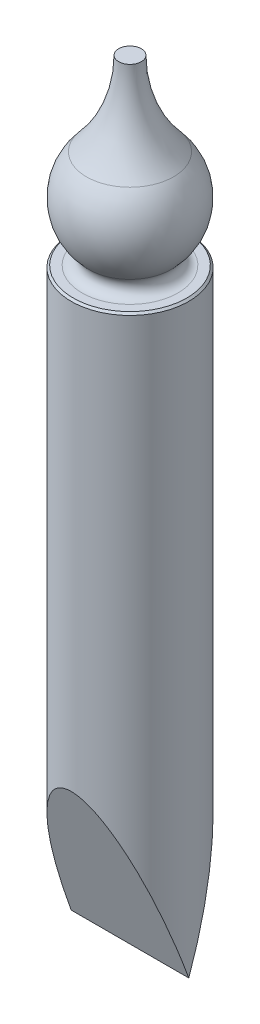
from build123d import *

# Parameters (mm, degrees)
CUT_EXTRUDE_1_DEPTH = 5
CHAMFER_1_SIZE      = 0.1


with BuildPart() as part:
    # Sketch 1 → Revolve 1 (revolve)
    with BuildSketch(Plane.XY, mode=Mode.PRIVATE) as revolve_1_sk:
        with BuildLine():
            Line((-3, 0), (0, 0))
            Line((0, 0), (0, 39.282266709))
            Line((0, 39.282266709), (-0.575, 39.282266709))
            ThreePointArc((-0.575, 39.282266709), (-1.001022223, 36.995568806), (-2.221925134, 35.015700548))
            ThreePointArc((-2.221925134, 35.015700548), (-2.998702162, 32.911765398), (-2.099562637, 30.857142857))
            ThreePointArc((-2.099562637, 30.857142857), (-1.986579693, 30.311017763), (-2.449489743, 30))
            Line((-2.449489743, 30), (-3, 30))
            Line((-3, 30), (-3, 0))
        make_face()
    revolve(revolve_1_sk.sketch.rotate(Axis((0, 0, 0), (0, 1, 0)), 270), axis=Axis((0, 0, 0), (0, 1, 0)))

    # Sketch 3 → Cut-Extrude 1 (cut, symmetric)
    with BuildSketch(Plane(origin=(0, 0, 0), x_dir=(0, 0, -1), z_dir=(1, 0, 0))):
        Polygon((0, 0), (-3, 8.242432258), (-3, -1.164741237), (3, -1.164741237), (3, 8.242432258), align=None)
    extrude(amount=CUT_EXTRUDE_1_DEPTH, both=True, mode=Mode.SUBTRACT)

    # Chamfer 1
    chamfer_1_edges = [part.edges().sort_by_distance(p)[0] for p in [
        (0, 30, 3),
    ]]
    chamfer(chamfer_1_edges, length=CHAMFER_1_SIZE)


solid = part.part
